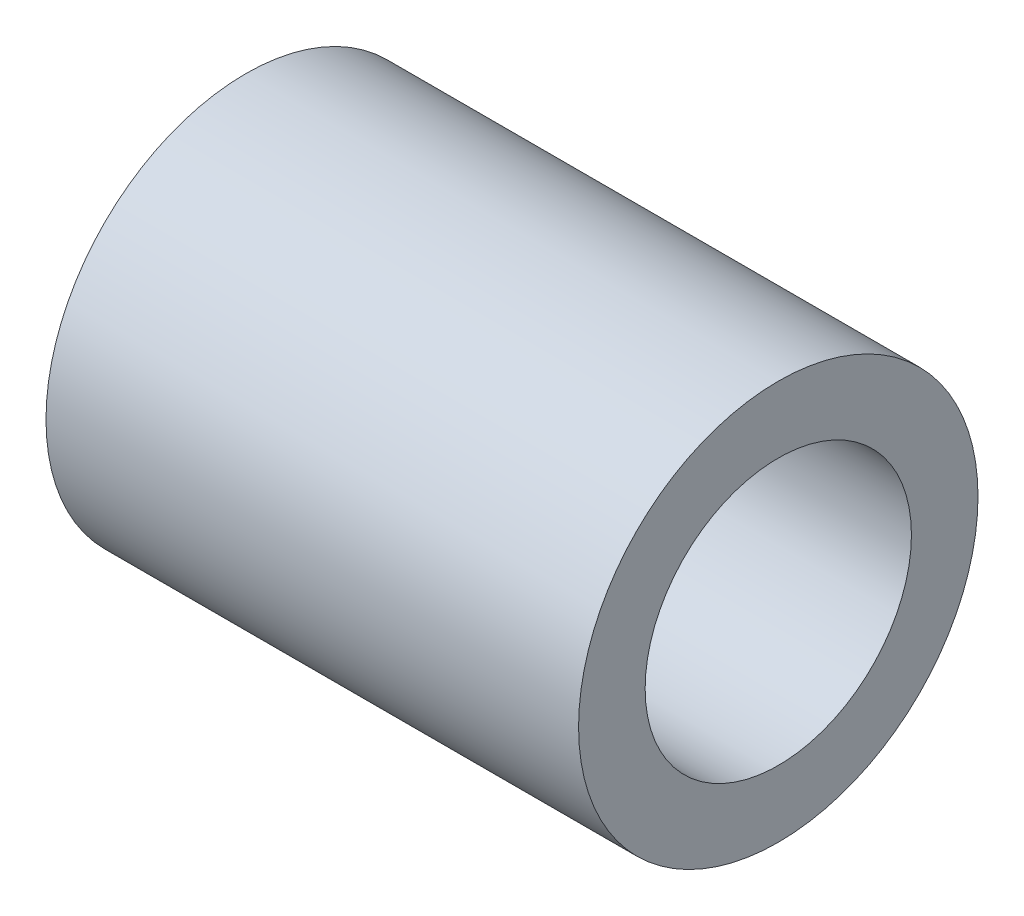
ISO-10303-21;
HEADER;
FILE_DESCRIPTION(('STEP AP214'),'2;1');
FILE_NAME('part.step','',(''),(''),'','','');
FILE_SCHEMA(('AUTOMOTIVE_DESIGN { 1 0 10303 214 1 1 1 1 }'));
ENDSEC;
DATA;
#1=APPLICATION_CONTEXT('core data for automotive mechanical design processes');
#2=APPLICATION_PROTOCOL_DEFINITION('international standard','automotive_design',2000,#1);
#3=PRODUCT_CONTEXT('',#1,'mechanical');
#4=PRODUCT('Part','Part','',(#3));
#5=PRODUCT_RELATED_PRODUCT_CATEGORY('part','',(#4));
#6=PRODUCT_DEFINITION_FORMATION('','',#4);
#7=PRODUCT_DEFINITION_CONTEXT('part definition',#1,'design');
#8=PRODUCT_DEFINITION('design','',#6,#7);
#9=PRODUCT_DEFINITION_SHAPE('','',#8);
#10=(LENGTH_UNIT() NAMED_UNIT(*) SI_UNIT(.MILLI.,.METRE.));
#11=(NAMED_UNIT(*) PLANE_ANGLE_UNIT() SI_UNIT($,.RADIAN.));
#12=(NAMED_UNIT(*) SI_UNIT($,.STERADIAN.) SOLID_ANGLE_UNIT());
#13=UNCERTAINTY_MEASURE_WITH_UNIT(LENGTH_MEASURE(1.E-05),#10,'distance_accuracy_value','');
#14=(GEOMETRIC_REPRESENTATION_CONTEXT(3) GLOBAL_UNCERTAINTY_ASSIGNED_CONTEXT((#13)) GLOBAL_UNIT_ASSIGNED_CONTEXT((#10,
#11,#12)) REPRESENTATION_CONTEXT('',''));
#15=CARTESIAN_POINT('',(0.,0.,0.));
#16=DIRECTION('',(0.,0.,1.));
#17=DIRECTION('',(1.,0.,0.));
#18=AXIS2_PLACEMENT_3D('',#15,#16,#17);
#19=CARTESIAN_POINT('',(12.,0.,0.));
#20=DIRECTION('',(1.,0.,0.));
#21=DIRECTION('',(0.,0.,-1.));
#22=AXIS2_PLACEMENT_3D('',#19,#20,#21);
#23=PLANE('',#22);
#24=CARTESIAN_POINT('',(12.,0.,0.));
#25=DIRECTION('',(1.,0.,0.));
#26=DIRECTION('',(0.,0.,-1.));
#27=AXIS2_PLACEMENT_3D('',#24,#25,#26);
#28=CIRCLE('',#27,4.5);
#29=CARTESIAN_POINT('',(12.,0.,-4.5));
#30=VERTEX_POINT('',#29);
#31=EDGE_CURVE('E10',#30,#30,#28,.T.);
#32=ORIENTED_EDGE('',*,*,#31,.T.);
#33=EDGE_LOOP('',(#32));
#34=FACE_BOUND('',#33,.T.);
#35=CARTESIAN_POINT('',(12.,0.,0.));
#36=DIRECTION('',(1.,0.,0.));
#37=DIRECTION('',(0.,0.,-1.));
#38=AXIS2_PLACEMENT_3D('',#35,#36,#37);
#39=CIRCLE('',#38,3.);
#40=CARTESIAN_POINT('',(12.,0.,-3.));
#41=VERTEX_POINT('',#40);
#42=EDGE_CURVE('E54',#41,#41,#39,.T.);
#43=ORIENTED_EDGE('',*,*,#42,.F.);
#44=EDGE_LOOP('',(#43));
#45=FACE_BOUND('',#44,.T.);
#46=ADVANCED_FACE('F41',(#34,#45),#23,.T.);
#47=CARTESIAN_POINT('',(0.,0.,0.));
#48=DIRECTION('',(1.,0.,0.));
#49=DIRECTION('',(0.,0.,-1.));
#50=AXIS2_PLACEMENT_3D('',#47,#48,#49);
#51=PLANE('',#50);
#52=CARTESIAN_POINT('',(0.,0.,0.));
#53=DIRECTION('',(1.,0.,0.));
#54=DIRECTION('',(0.,0.,-1.));
#55=AXIS2_PLACEMENT_3D('',#52,#53,#54);
#56=CIRCLE('',#55,4.5);
#57=CARTESIAN_POINT('',(0.,0.,-4.5));
#58=VERTEX_POINT('',#57);
#59=EDGE_CURVE('E45',#58,#58,#56,.T.);
#60=ORIENTED_EDGE('',*,*,#59,.F.);
#61=EDGE_LOOP('',(#60));
#62=FACE_BOUND('',#61,.T.);
#63=CARTESIAN_POINT('',(0.,0.,0.));
#64=DIRECTION('',(1.,0.,0.));
#65=DIRECTION('',(0.,0.,-1.));
#66=AXIS2_PLACEMENT_3D('',#63,#64,#65);
#67=CIRCLE('',#66,3.);
#68=CARTESIAN_POINT('',(0.,0.,-3.));
#69=VERTEX_POINT('',#68);
#70=EDGE_CURVE('E56',#69,#69,#67,.T.);
#71=ORIENTED_EDGE('',*,*,#70,.T.);
#72=EDGE_LOOP('',(#71));
#73=FACE_BOUND('',#72,.T.);
#74=ADVANCED_FACE('F68',(#62,#73),#51,.F.);
#75=CARTESIAN_POINT('',(12.,0.,0.));
#76=DIRECTION('',(-1.,0.,0.));
#77=DIRECTION('',(0.,0.,1.));
#78=AXIS2_PLACEMENT_3D('',#75,#76,#77);
#79=CYLINDRICAL_SURFACE('',#78,4.5);
#80=ORIENTED_EDGE('',*,*,#31,.F.);
#81=EDGE_LOOP('',(#80));
#82=FACE_BOUND('',#81,.T.);
#83=ORIENTED_EDGE('',*,*,#59,.T.);
#84=EDGE_LOOP('',(#83));
#85=FACE_BOUND('',#84,.T.);
#86=ADVANCED_FACE('F43',(#82,#85),#79,.T.);
#87=CARTESIAN_POINT('',(12.,0.,0.));
#88=DIRECTION('',(-1.,0.,0.));
#89=DIRECTION('',(0.,0.,1.));
#90=AXIS2_PLACEMENT_3D('',#87,#88,#89);
#91=CYLINDRICAL_SURFACE('',#90,3.);
#92=ORIENTED_EDGE('',*,*,#42,.T.);
#93=EDGE_LOOP('',(#92));
#94=FACE_BOUND('',#93,.T.);
#95=ORIENTED_EDGE('',*,*,#70,.F.);
#96=EDGE_LOOP('',(#95));
#97=FACE_BOUND('',#96,.T.);
#98=ADVANCED_FACE('F64',(#94,#97),#91,.F.);
#99=CLOSED_SHELL('',(#46,#74,#86,#98));
#100=MANIFOLD_SOLID_BREP('B2',#99);
#101=ADVANCED_BREP_SHAPE_REPRESENTATION('',(#18,#100),#14);
#102=SHAPE_DEFINITION_REPRESENTATION(#9,#101);
ENDSEC;
END-ISO-10303-21;
